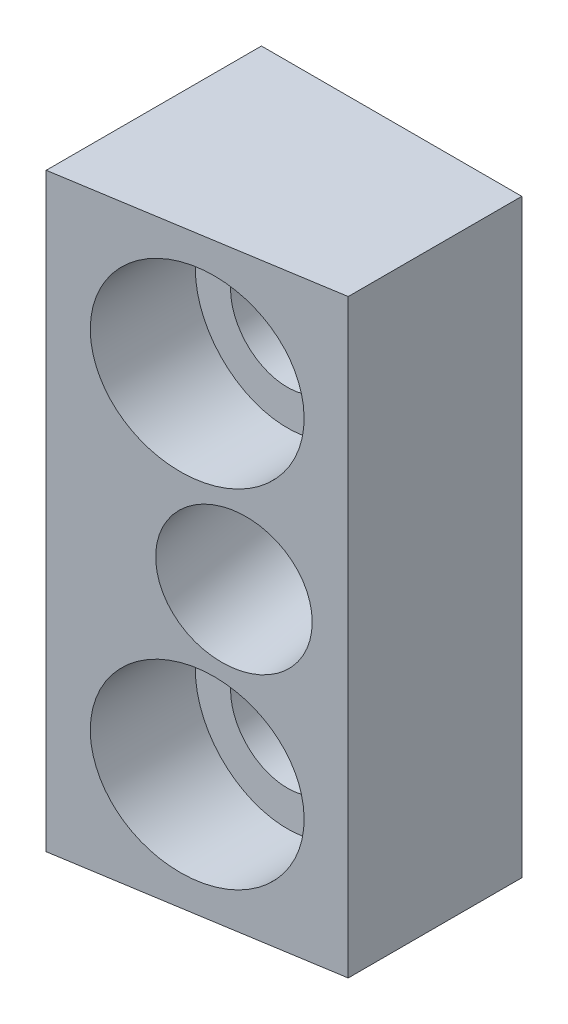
ISO-10303-21;
HEADER;
FILE_DESCRIPTION(('STEP AP214'),'2;1');
FILE_NAME('part.step','',(''),(''),'','','');
FILE_SCHEMA(('AUTOMOTIVE_DESIGN { 1 0 10303 214 1 1 1 1 }'));
ENDSEC;
DATA;
#1=APPLICATION_CONTEXT('core data for automotive mechanical design processes');
#2=APPLICATION_PROTOCOL_DEFINITION('international standard','automotive_design',2000,#1);
#3=PRODUCT_CONTEXT('',#1,'mechanical');
#4=PRODUCT('Part','Part','',(#3));
#5=PRODUCT_RELATED_PRODUCT_CATEGORY('part','',(#4));
#6=PRODUCT_DEFINITION_FORMATION('','',#4);
#7=PRODUCT_DEFINITION_CONTEXT('part definition',#1,'design');
#8=PRODUCT_DEFINITION('design','',#6,#7);
#9=PRODUCT_DEFINITION_SHAPE('','',#8);
#10=(LENGTH_UNIT() NAMED_UNIT(*) SI_UNIT(.MILLI.,.METRE.));
#11=(NAMED_UNIT(*) PLANE_ANGLE_UNIT() SI_UNIT($,.RADIAN.));
#12=(NAMED_UNIT(*) SI_UNIT($,.STERADIAN.) SOLID_ANGLE_UNIT());
#13=UNCERTAINTY_MEASURE_WITH_UNIT(LENGTH_MEASURE(1.E-05),#10,'distance_accuracy_value','');
#14=(GEOMETRIC_REPRESENTATION_CONTEXT(3) GLOBAL_UNCERTAINTY_ASSIGNED_CONTEXT((#13)) GLOBAL_UNIT_ASSIGNED_CONTEXT((#10,
#11,#12)) REPRESENTATION_CONTEXT('',''));
#15=CARTESIAN_POINT('',(0.,0.,0.));
#16=DIRECTION('',(0.,0.,1.));
#17=DIRECTION('',(1.,0.,0.));
#18=AXIS2_PLACEMENT_3D('',#15,#16,#17);
#19=CARTESIAN_POINT('',(-9.525,-8.89,0.));
#20=DIRECTION('',(0.,0.,1.));
#21=DIRECTION('',(0.,-1.,0.));
#22=AXIS2_PLACEMENT_3D('',#19,#20,#21);
#23=PLANE('',#22);
#24=CARTESIAN_POINT('',(0.100150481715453,12.7,0.));
#25=DIRECTION('',(0.,0.,1.));
#26=DIRECTION('',(1.,0.,0.));
#27=AXIS2_PLACEMENT_3D('',#24,#25,#26);
#28=ELLIPSE('',#27,5.06359556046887,5.);
#29=CARTESIAN_POINT('',(5.16374604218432,12.7,0.));
#30=VERTEX_POINT('',#29);
#31=EDGE_CURVE('E114',#30,#30,#28,.T.);
#32=ORIENTED_EDGE('',*,*,#31,.T.);
#33=EDGE_LOOP('',(#32));
#34=FACE_BOUND('',#33,.T.);
#35=CARTESIAN_POINT('',(0.,0.,0.));
#36=DIRECTION('',(0.,0.,1.));
#37=DIRECTION('',(0.,-1.,0.));
#38=AXIS2_PLACEMENT_3D('',#35,#36,#37);
#39=CIRCLE('',#38,4.1656);
#40=CARTESIAN_POINT('',(0.,-4.1656,0.));
#41=VERTEX_POINT('',#40);
#42=EDGE_CURVE('E76',#41,#41,#39,.F.);
#43=ORIENTED_EDGE('',*,*,#42,.F.);
#44=EDGE_LOOP('',(#43));
#45=FACE_BOUND('',#44,.T.);
#46=DIRECTION('',(1.,0.,0.));
#47=VECTOR('',#46,1.);
#48=CARTESIAN_POINT('',(-9.525,34.29,0.));
#49=LINE('',#48,#47);
#50=CARTESIAN_POINT('',(-9.525,34.29,0.));
#51=VERTEX_POINT('',#50);
#52=CARTESIAN_POINT('',(9.525,34.29,0.));
#53=VERTEX_POINT('',#52);
#54=EDGE_CURVE('E59',#51,#53,#49,.T.);
#55=ORIENTED_EDGE('',*,*,#54,.T.);
#56=DIRECTION('',(0.,1.,0.));
#57=VECTOR('',#56,1.);
#58=CARTESIAN_POINT('',(9.525,-8.89,0.));
#59=LINE('',#58,#57);
#60=CARTESIAN_POINT('',(9.525,-8.89,0.));
#61=VERTEX_POINT('',#60);
#62=EDGE_CURVE('E26',#61,#53,#59,.T.);
#63=ORIENTED_EDGE('',*,*,#62,.F.);
#64=DIRECTION('',(1.,0.,0.));
#65=VECTOR('',#64,1.);
#66=CARTESIAN_POINT('',(-9.525,-8.89,0.));
#67=LINE('',#66,#65);
#68=CARTESIAN_POINT('',(-9.525,-8.89,0.));
#69=VERTEX_POINT('',#68);
#70=EDGE_CURVE('E71',#69,#61,#67,.T.);
#71=ORIENTED_EDGE('',*,*,#70,.F.);
#72=DIRECTION('',(0.,1.,0.));
#73=VECTOR('',#72,1.);
#74=CARTESIAN_POINT('',(-9.525,-8.89,0.));
#75=LINE('',#74,#73);
#76=EDGE_CURVE('E10',#69,#51,#75,.T.);
#77=ORIENTED_EDGE('',*,*,#76,.T.);
#78=EDGE_LOOP('',(#55,#63,#71,#77));
#79=FACE_BOUND('',#78,.T.);
#80=CARTESIAN_POINT('',(0.,25.4,0.));
#81=DIRECTION('',(0.,0.,1.));
#82=DIRECTION('',(0.,-1.,0.));
#83=AXIS2_PLACEMENT_3D('',#80,#81,#82);
#84=CIRCLE('',#83,4.1656);
#85=CARTESIAN_POINT('',(0.,21.2344,0.));
#86=VERTEX_POINT('',#85);
#87=EDGE_CURVE('E21',#86,#86,#84,.F.);
#88=ORIENTED_EDGE('',*,*,#87,.F.);
#89=EDGE_LOOP('',(#88));
#90=FACE_BOUND('',#89,.T.);
#91=ADVANCED_FACE('F17',(#34,#45,#79,#90),#23,.F.);
#92=CARTESIAN_POINT('',(9.525,-8.89,12.7));
#93=DIRECTION('',(-0.157990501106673,0.,-0.987440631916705));
#94=DIRECTION('',(0.987440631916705,0.,-0.157990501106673));
#95=AXIS2_PLACEMENT_3D('',#92,#93,#94);
#96=PLANE('',#95);
#97=CARTESIAN_POINT('',(2.31668338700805,12.7,13.8533306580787));
#98=DIRECTION('',(0.157990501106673,0.,0.987440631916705));
#99=DIRECTION('',(0.987440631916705,0.,-0.157990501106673));
#100=AXIS2_PLACEMENT_3D('',#97,#98,#99);
#101=CIRCLE('',#100,5.);
#102=CARTESIAN_POINT('',(7.25388654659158,12.7,13.0633781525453));
#103=VERTEX_POINT('',#102);
#104=EDGE_CURVE('E257',#103,#103,#101,.T.);
#105=ORIENTED_EDGE('',*,*,#104,.F.);
#106=EDGE_LOOP('',(#105));
#107=FACE_BOUND('',#106,.T.);
#108=CARTESIAN_POINT('',(0.,0.,14.224));
#109=DIRECTION('',(-0.157990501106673,0.,-0.987440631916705));
#110=DIRECTION('',(-0.987440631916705,0.,0.157990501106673));
#111=AXIS2_PLACEMENT_3D('',#108,#109,#110);
#112=ELLIPSE('',#111,6.82947387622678,6.7437);
#113=CARTESIAN_POINT('',(-6.7437,0.,15.302992));
#114=VERTEX_POINT('',#113);
#115=EDGE_CURVE('E79',#114,#114,#112,.F.);
#116=ORIENTED_EDGE('',*,*,#115,.F.);
#117=EDGE_LOOP('',(#116));
#118=FACE_BOUND('',#117,.T.);
#119=DIRECTION('',(-0.987440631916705,0.,0.157990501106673));
#120=VECTOR('',#119,1.);
#121=CARTESIAN_POINT('',(9.525,34.29,12.7));
#122=LINE('',#121,#120);
#123=CARTESIAN_POINT('',(9.525,34.29,12.7));
#124=VERTEX_POINT('',#123);
#125=CARTESIAN_POINT('',(-9.525,34.29,15.748));
#126=VERTEX_POINT('',#125);
#127=EDGE_CURVE('E86',#124,#126,#122,.T.);
#128=ORIENTED_EDGE('',*,*,#127,.T.);
#129=DIRECTION('',(0.,1.,0.));
#130=VECTOR('',#129,1.);
#131=CARTESIAN_POINT('',(-9.525,-8.89,15.748));
#132=LINE('',#131,#130);
#133=CARTESIAN_POINT('',(-9.525,-8.89,15.748));
#134=VERTEX_POINT('',#133);
#135=EDGE_CURVE('E75',#134,#126,#132,.T.);
#136=ORIENTED_EDGE('',*,*,#135,.F.);
#137=DIRECTION('',(-0.987440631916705,0.,0.157990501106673));
#138=VECTOR('',#137,1.);
#139=CARTESIAN_POINT('',(9.525,-8.89,12.7));
#140=LINE('',#139,#138);
#141=CARTESIAN_POINT('',(9.525,-8.89,12.7));
#142=VERTEX_POINT('',#141);
#143=EDGE_CURVE('E33',#142,#134,#140,.T.);
#144=ORIENTED_EDGE('',*,*,#143,.F.);
#145=DIRECTION('',(0.,1.,0.));
#146=VECTOR('',#145,1.);
#147=CARTESIAN_POINT('',(9.525,-8.89,12.7));
#148=LINE('',#147,#146);
#149=EDGE_CURVE('E95',#142,#124,#148,.T.);
#150=ORIENTED_EDGE('',*,*,#149,.T.);
#151=EDGE_LOOP('',(#128,#136,#144,#150));
#152=FACE_BOUND('',#151,.T.);
#153=CARTESIAN_POINT('',(0.,25.4,14.224));
#154=DIRECTION('',(-0.157990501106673,0.,-0.987440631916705));
#155=DIRECTION('',(-0.987440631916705,0.,0.157990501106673));
#156=AXIS2_PLACEMENT_3D('',#153,#154,#155);
#157=ELLIPSE('',#156,6.82947387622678,6.7437);
#158=CARTESIAN_POINT('',(-6.7437,25.4,15.302992));
#159=VERTEX_POINT('',#158);
#160=EDGE_CURVE('E101',#159,#159,#157,.F.);
#161=ORIENTED_EDGE('',*,*,#160,.F.);
#162=EDGE_LOOP('',(#161));
#163=FACE_BOUND('',#162,.T.);
#164=ADVANCED_FACE('F143',(#107,#118,#152,#163),#96,.F.);
#165=CARTESIAN_POINT('',(-9.525,-8.89,15.748));
#166=DIRECTION('',(1.,0.,0.));
#167=DIRECTION('',(0.,0.,1.));
#168=AXIS2_PLACEMENT_3D('',#165,#166,#167);
#169=PLANE('',#168);
#170=DIRECTION('',(0.,0.,-1.));
#171=VECTOR('',#170,1.);
#172=CARTESIAN_POINT('',(-9.525,34.29,15.748));
#173=LINE('',#172,#171);
#174=EDGE_CURVE('E63',#126,#51,#173,.T.);
#175=ORIENTED_EDGE('',*,*,#174,.T.);
#176=ORIENTED_EDGE('',*,*,#76,.F.);
#177=DIRECTION('',(0.,0.,-1.));
#178=VECTOR('',#177,1.);
#179=CARTESIAN_POINT('',(-9.525,-8.89,15.748));
#180=LINE('',#179,#178);
#181=EDGE_CURVE('E88',#134,#69,#180,.T.);
#182=ORIENTED_EDGE('',*,*,#181,.F.);
#183=ORIENTED_EDGE('',*,*,#135,.T.);
#184=EDGE_LOOP('',(#175,#176,#182,#183));
#185=FACE_BOUND('',#184,.T.);
#186=ADVANCED_FACE('F19',(#185),#169,.F.);
#187=CARTESIAN_POINT('',(9.525,-8.89,0.));
#188=DIRECTION('',(-1.,0.,0.));
#189=DIRECTION('',(0.,-1.,0.));
#190=AXIS2_PLACEMENT_3D('',#187,#188,#189);
#191=PLANE('',#190);
#192=DIRECTION('',(0.,0.,1.));
#193=VECTOR('',#192,1.);
#194=CARTESIAN_POINT('',(9.525,34.29,0.));
#195=LINE('',#194,#193);
#196=EDGE_CURVE('E64',#53,#124,#195,.T.);
#197=ORIENTED_EDGE('',*,*,#196,.T.);
#198=ORIENTED_EDGE('',*,*,#149,.F.);
#199=DIRECTION('',(0.,0.,1.));
#200=VECTOR('',#199,1.);
#201=CARTESIAN_POINT('',(9.525,-8.89,0.));
#202=LINE('',#201,#200);
#203=EDGE_CURVE('E38',#61,#142,#202,.T.);
#204=ORIENTED_EDGE('',*,*,#203,.F.);
#205=ORIENTED_EDGE('',*,*,#62,.T.);
#206=EDGE_LOOP('',(#197,#198,#204,#205));
#207=FACE_BOUND('',#206,.T.);
#208=ADVANCED_FACE('F154',(#207),#191,.F.);
#209=CARTESIAN_POINT('',(-9.525,-8.89,0.));
#210=DIRECTION('',(0.,-1.,0.));
#211=DIRECTION('',(1.,0.,0.));
#212=AXIS2_PLACEMENT_3D('',#209,#210,#211);
#213=PLANE('',#212);
#214=ORIENTED_EDGE('',*,*,#181,.T.);
#215=ORIENTED_EDGE('',*,*,#70,.T.);
#216=ORIENTED_EDGE('',*,*,#203,.T.);
#217=ORIENTED_EDGE('',*,*,#143,.T.);
#218=EDGE_LOOP('',(#214,#215,#216,#217));
#219=FACE_BOUND('',#218,.T.);
#220=ADVANCED_FACE('F156',(#219),#213,.T.);
#221=CARTESIAN_POINT('',(-9.525,34.29,0.));
#222=DIRECTION('',(0.,-1.,0.));
#223=DIRECTION('',(1.,0.,0.));
#224=AXIS2_PLACEMENT_3D('',#221,#222,#223);
#225=PLANE('',#224);
#226=ORIENTED_EDGE('',*,*,#174,.F.);
#227=ORIENTED_EDGE('',*,*,#127,.F.);
#228=ORIENTED_EDGE('',*,*,#196,.F.);
#229=ORIENTED_EDGE('',*,*,#54,.F.);
#230=EDGE_LOOP('',(#226,#227,#228,#229));
#231=FACE_BOUND('',#230,.T.);
#232=ADVANCED_FACE('F60',(#231),#225,.F.);
#233=CARTESIAN_POINT('',(0.,0.,20.5709860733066));
#234=DIRECTION('',(0.,0.,1.));
#235=DIRECTION('',(-1.,0.,0.));
#236=AXIS2_PLACEMENT_3D('',#233,#234,#235);
#237=CYLINDRICAL_SURFACE('',#236,4.1656);
#238=CARTESIAN_POINT('',(0.,0.,7.62));
#239=DIRECTION('',(0.,0.,1.));
#240=DIRECTION('',(-1.,0.,0.));
#241=AXIS2_PLACEMENT_3D('',#238,#239,#240);
#242=CIRCLE('',#241,4.1656);
#243=CARTESIAN_POINT('',(-4.1656,0.,7.62));
#244=VERTEX_POINT('',#243);
#245=EDGE_CURVE('E82',#244,#244,#242,.T.);
#246=ORIENTED_EDGE('',*,*,#245,.T.);
#247=EDGE_LOOP('',(#246));
#248=FACE_BOUND('',#247,.T.);
#249=ORIENTED_EDGE('',*,*,#42,.T.);
#250=EDGE_LOOP('',(#249));
#251=FACE_BOUND('',#250,.T.);
#252=ADVANCED_FACE('F123',(#248,#251),#237,.F.);
#253=CARTESIAN_POINT('',(0.,0.,20.5709860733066));
#254=DIRECTION('',(0.,0.,1.));
#255=DIRECTION('',(-1.,0.,0.));
#256=AXIS2_PLACEMENT_3D('',#253,#254,#255);
#257=CYLINDRICAL_SURFACE('',#256,6.7437);
#258=CARTESIAN_POINT('',(0.,0.,7.62));
#259=DIRECTION('',(0.,0.,1.));
#260=DIRECTION('',(-1.,0.,0.));
#261=AXIS2_PLACEMENT_3D('',#258,#259,#260);
#262=CIRCLE('',#261,6.7437);
#263=CARTESIAN_POINT('',(-6.7437,0.,7.62));
#264=VERTEX_POINT('',#263);
#265=EDGE_CURVE('E107',#264,#264,#262,.T.);
#266=ORIENTED_EDGE('',*,*,#265,.F.);
#267=EDGE_LOOP('',(#266));
#268=FACE_BOUND('',#267,.T.);
#269=ORIENTED_EDGE('',*,*,#115,.T.);
#270=EDGE_LOOP('',(#269));
#271=FACE_BOUND('',#270,.T.);
#272=ADVANCED_FACE('F129',(#268,#271),#257,.F.);
#273=CARTESIAN_POINT('',(6.7437,0.,7.62));
#274=DIRECTION('',(0.,0.,1.));
#275=DIRECTION('',(-1.,0.,0.));
#276=AXIS2_PLACEMENT_3D('',#273,#274,#275);
#277=PLANE('',#276);
#278=ORIENTED_EDGE('',*,*,#265,.T.);
#279=EDGE_LOOP('',(#278));
#280=FACE_BOUND('',#279,.T.);
#281=ORIENTED_EDGE('',*,*,#245,.F.);
#282=EDGE_LOOP('',(#281));
#283=FACE_BOUND('',#282,.T.);
#284=ADVANCED_FACE('F126',(#280,#283),#277,.T.);
#285=CARTESIAN_POINT('',(0.,25.4,20.5709860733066));
#286=DIRECTION('',(0.,0.,1.));
#287=DIRECTION('',(-1.,0.,0.));
#288=AXIS2_PLACEMENT_3D('',#285,#286,#287);
#289=CYLINDRICAL_SURFACE('',#288,4.1656);
#290=CARTESIAN_POINT('',(0.,25.4,7.62));
#291=DIRECTION('',(0.,0.,1.));
#292=DIRECTION('',(-1.,0.,0.));
#293=AXIS2_PLACEMENT_3D('',#290,#291,#292);
#294=CIRCLE('',#293,4.1656);
#295=CARTESIAN_POINT('',(-4.1656,25.4,7.62));
#296=VERTEX_POINT('',#295);
#297=EDGE_CURVE('E103',#296,#296,#294,.T.);
#298=ORIENTED_EDGE('',*,*,#297,.T.);
#299=EDGE_LOOP('',(#298));
#300=FACE_BOUND('',#299,.T.);
#301=ORIENTED_EDGE('',*,*,#87,.T.);
#302=EDGE_LOOP('',(#301));
#303=FACE_BOUND('',#302,.T.);
#304=ADVANCED_FACE('F128',(#300,#303),#289,.F.);
#305=CARTESIAN_POINT('',(0.,25.4,20.5709860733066));
#306=DIRECTION('',(0.,0.,1.));
#307=DIRECTION('',(-1.,0.,0.));
#308=AXIS2_PLACEMENT_3D('',#305,#306,#307);
#309=CYLINDRICAL_SURFACE('',#308,6.7437);
#310=CARTESIAN_POINT('',(0.,25.4,7.62));
#311=DIRECTION('',(0.,0.,1.));
#312=DIRECTION('',(-1.,0.,0.));
#313=AXIS2_PLACEMENT_3D('',#310,#311,#312);
#314=CIRCLE('',#313,6.7437);
#315=CARTESIAN_POINT('',(-6.7437,25.4,7.62));
#316=VERTEX_POINT('',#315);
#317=EDGE_CURVE('E109',#316,#316,#314,.T.);
#318=ORIENTED_EDGE('',*,*,#317,.F.);
#319=EDGE_LOOP('',(#318));
#320=FACE_BOUND('',#319,.T.);
#321=ORIENTED_EDGE('',*,*,#160,.T.);
#322=EDGE_LOOP('',(#321));
#323=FACE_BOUND('',#322,.T.);
#324=ADVANCED_FACE('F137',(#320,#323),#309,.F.);
#325=CARTESIAN_POINT('',(6.7437,25.4,7.62));
#326=DIRECTION('',(0.,0.,1.));
#327=DIRECTION('',(-1.,0.,0.));
#328=AXIS2_PLACEMENT_3D('',#325,#326,#327);
#329=PLANE('',#328);
#330=ORIENTED_EDGE('',*,*,#317,.T.);
#331=EDGE_LOOP('',(#330));
#332=FACE_BOUND('',#331,.T.);
#333=ORIENTED_EDGE('',*,*,#297,.F.);
#334=EDGE_LOOP('',(#333));
#335=FACE_BOUND('',#334,.T.);
#336=ADVANCED_FACE('F197',(#332,#335),#329,.T.);
#337=CARTESIAN_POINT('',(-0.140102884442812,12.7,-1.50158353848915));
#338=DIRECTION('',(0.157990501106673,0.,0.987440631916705));
#339=DIRECTION('',(0.987440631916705,0.,-0.157990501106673));
#340=AXIS2_PLACEMENT_3D('',#337,#338,#339);
#341=CYLINDRICAL_SURFACE('',#340,5.);
#342=ORIENTED_EDGE('',*,*,#104,.T.);
#343=EDGE_LOOP('',(#342));
#344=FACE_BOUND('',#343,.T.);
#345=ORIENTED_EDGE('',*,*,#31,.F.);
#346=EDGE_LOOP('',(#345));
#347=FACE_BOUND('',#346,.T.);
#348=ADVANCED_FACE('F207',(#344,#347),#341,.F.);
#349=CLOSED_SHELL('',(#91,#164,#186,#208,#220,#232,#252,#272,#284,#304,#324,#336,#348));
#350=MANIFOLD_SOLID_BREP('B1',#349);
#351=ADVANCED_BREP_SHAPE_REPRESENTATION('',(#18,#350),#14);
#352=SHAPE_DEFINITION_REPRESENTATION(#9,#351);
ENDSEC;
END-ISO-10303-21;
